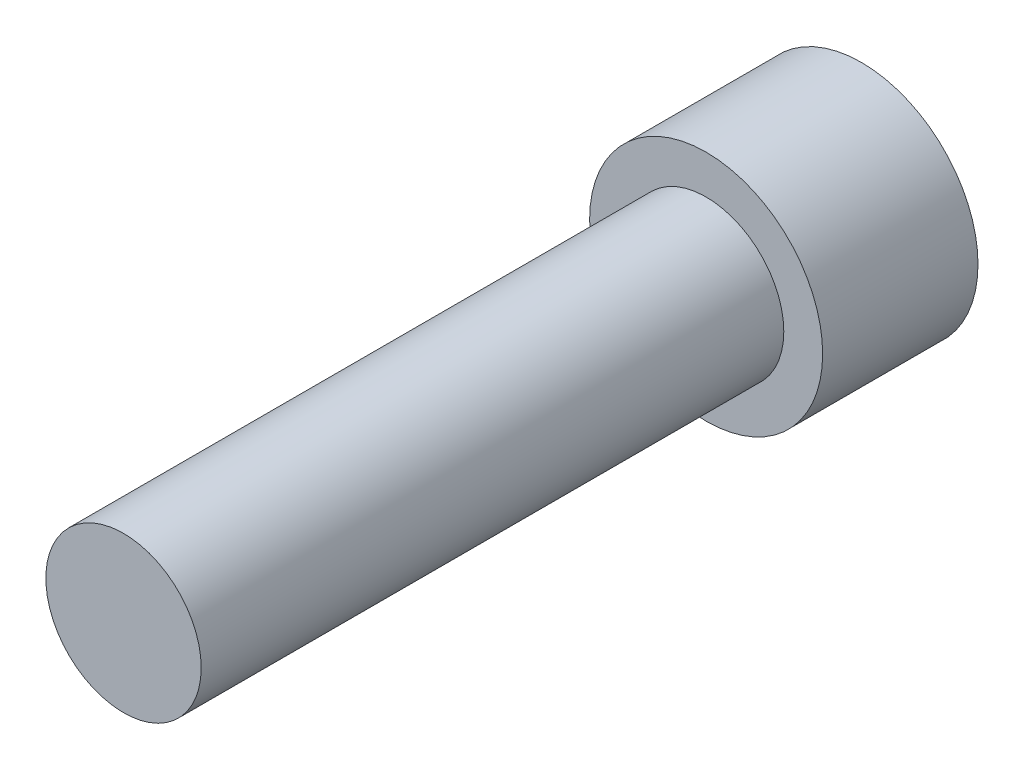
ISO-10303-21;
HEADER;
FILE_DESCRIPTION(('STEP AP214'),'2;1');
FILE_NAME('part.step','',(''),(''),'','','');
FILE_SCHEMA(('AUTOMOTIVE_DESIGN { 1 0 10303 214 1 1 1 1 }'));
ENDSEC;
DATA;
#1=APPLICATION_CONTEXT('core data for automotive mechanical design processes');
#2=APPLICATION_PROTOCOL_DEFINITION('international standard','automotive_design',2000,#1);
#3=PRODUCT_CONTEXT('',#1,'mechanical');
#4=PRODUCT('Part','Part','',(#3));
#5=PRODUCT_RELATED_PRODUCT_CATEGORY('part','',(#4));
#6=PRODUCT_DEFINITION_FORMATION('','',#4);
#7=PRODUCT_DEFINITION_CONTEXT('part definition',#1,'design');
#8=PRODUCT_DEFINITION('design','',#6,#7);
#9=PRODUCT_DEFINITION_SHAPE('','',#8);
#10=(LENGTH_UNIT() NAMED_UNIT(*) SI_UNIT(.MILLI.,.METRE.));
#11=(NAMED_UNIT(*) PLANE_ANGLE_UNIT() SI_UNIT($,.RADIAN.));
#12=(NAMED_UNIT(*) SI_UNIT($,.STERADIAN.) SOLID_ANGLE_UNIT());
#13=UNCERTAINTY_MEASURE_WITH_UNIT(LENGTH_MEASURE(1.E-05),#10,'distance_accuracy_value','');
#14=(GEOMETRIC_REPRESENTATION_CONTEXT(3) GLOBAL_UNCERTAINTY_ASSIGNED_CONTEXT((#13)) GLOBAL_UNIT_ASSIGNED_CONTEXT((#10,
#11,#12)) REPRESENTATION_CONTEXT('',''));
#15=CARTESIAN_POINT('',(0.,0.,0.));
#16=DIRECTION('',(0.,0.,1.));
#17=DIRECTION('',(1.,0.,0.));
#18=AXIS2_PLACEMENT_3D('',#15,#16,#17);
#19=CARTESIAN_POINT('',(0.,0.,45.));
#20=DIRECTION('',(0.,0.,1.));
#21=DIRECTION('',(1.,0.,0.));
#22=AXIS2_PLACEMENT_3D('',#19,#20,#21);
#23=PLANE('',#22);
#24=CARTESIAN_POINT('',(0.,0.,45.));
#25=DIRECTION('',(0.,0.,1.));
#26=DIRECTION('',(1.,0.,0.));
#27=AXIS2_PLACEMENT_3D('',#24,#25,#26);
#28=CIRCLE('',#27,6.);
#29=CARTESIAN_POINT('',(6.,0.,45.));
#30=VERTEX_POINT('',#29);
#31=EDGE_CURVE('E11',#30,#30,#28,.T.);
#32=ORIENTED_EDGE('',*,*,#31,.T.);
#33=EDGE_LOOP('',(#32));
#34=FACE_BOUND('',#33,.T.);
#35=ADVANCED_FACE('F32',(#34),#23,.T.);
#36=CARTESIAN_POINT('',(0.,0.,45.));
#37=DIRECTION('',(0.,0.,1.));
#38=DIRECTION('',(1.,0.,0.));
#39=AXIS2_PLACEMENT_3D('',#36,#37,#38);
#40=CYLINDRICAL_SURFACE('',#39,6.);
#41=CARTESIAN_POINT('',(0.,0.,0.));
#42=DIRECTION('',(0.,0.,1.));
#43=DIRECTION('',(1.,0.,0.));
#44=AXIS2_PLACEMENT_3D('',#41,#42,#43);
#45=CIRCLE('',#44,6.);
#46=CARTESIAN_POINT('',(6.,0.,0.));
#47=VERTEX_POINT('',#46);
#48=EDGE_CURVE('E39',#47,#47,#45,.T.);
#49=ORIENTED_EDGE('',*,*,#48,.T.);
#50=EDGE_LOOP('',(#49));
#51=FACE_BOUND('',#50,.T.);
#52=ORIENTED_EDGE('',*,*,#31,.F.);
#53=EDGE_LOOP('',(#52));
#54=FACE_BOUND('',#53,.T.);
#55=ADVANCED_FACE('F146',(#51,#54),#40,.T.);
#56=CARTESIAN_POINT('',(0.,-6.,0.));
#57=DIRECTION('',(0.,0.,1.));
#58=DIRECTION('',(1.,0.,0.));
#59=AXIS2_PLACEMENT_3D('',#56,#57,#58);
#60=PLANE('',#59);
#61=CARTESIAN_POINT('',(0.,0.,0.));
#62=DIRECTION('',(0.,0.,1.));
#63=DIRECTION('',(1.,0.,0.));
#64=AXIS2_PLACEMENT_3D('',#61,#62,#63);
#65=CIRCLE('',#64,9.);
#66=CARTESIAN_POINT('',(9.,0.,0.));
#67=VERTEX_POINT('',#66);
#68=EDGE_CURVE('E141',#67,#67,#65,.T.);
#69=ORIENTED_EDGE('',*,*,#68,.T.);
#70=EDGE_LOOP('',(#69));
#71=FACE_BOUND('',#70,.T.);
#72=ORIENTED_EDGE('',*,*,#48,.F.);
#73=EDGE_LOOP('',(#72));
#74=FACE_BOUND('',#73,.T.);
#75=ADVANCED_FACE('F149',(#71,#74),#60,.T.);
#76=CARTESIAN_POINT('',(0.,0.,45.));
#77=DIRECTION('',(0.,0.,1.));
#78=DIRECTION('',(1.,0.,0.));
#79=AXIS2_PLACEMENT_3D('',#76,#77,#78);
#80=CYLINDRICAL_SURFACE('',#79,9.);
#81=CARTESIAN_POINT('',(0.,0.,-12.));
#82=DIRECTION('',(0.,0.,1.));
#83=DIRECTION('',(1.,0.,0.));
#84=AXIS2_PLACEMENT_3D('',#81,#82,#83);
#85=CIRCLE('',#84,9.);
#86=CARTESIAN_POINT('',(9.,0.,-12.));
#87=VERTEX_POINT('',#86);
#88=EDGE_CURVE('E133',#87,#87,#85,.T.);
#89=ORIENTED_EDGE('',*,*,#88,.T.);
#90=EDGE_LOOP('',(#89));
#91=FACE_BOUND('',#90,.T.);
#92=ORIENTED_EDGE('',*,*,#68,.F.);
#93=EDGE_LOOP('',(#92));
#94=FACE_BOUND('',#93,.T.);
#95=ADVANCED_FACE('F151',(#91,#94),#80,.T.);
#96=CARTESIAN_POINT('',(0.,-9.,-12.));
#97=DIRECTION('',(0.,0.,-1.));
#98=DIRECTION('',(-1.,0.,0.));
#99=AXIS2_PLACEMENT_3D('',#96,#97,#98);
#100=PLANE('',#99);
#101=DIRECTION('',(0.866025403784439,-0.5,0.));
#102=VECTOR('',#101,1.);
#103=CARTESIAN_POINT('',(0.,5.77350269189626,-12.));
#104=LINE('',#103,#102);
#105=CARTESIAN_POINT('',(0.,5.77350269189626,-12.));
#106=VERTEX_POINT('',#105);
#107=CARTESIAN_POINT('',(5.,2.88675134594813,-12.));
#108=VERTEX_POINT('',#107);
#109=EDGE_CURVE('E46',#106,#108,#104,.T.);
#110=ORIENTED_EDGE('',*,*,#109,.F.);
#111=DIRECTION('',(0.866025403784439,0.5,0.));
#112=VECTOR('',#111,1.);
#113=CARTESIAN_POINT('',(-5.,2.88675134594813,-12.));
#114=LINE('',#113,#112);
#115=CARTESIAN_POINT('',(-5.,2.88675134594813,-12.));
#116=VERTEX_POINT('',#115);
#117=EDGE_CURVE('E129',#116,#106,#114,.T.);
#118=ORIENTED_EDGE('',*,*,#117,.F.);
#119=DIRECTION('',(0.,1.,0.));
#120=VECTOR('',#119,1.);
#121=CARTESIAN_POINT('',(-5.,-2.88675134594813,-12.));
#122=LINE('',#121,#120);
#123=CARTESIAN_POINT('',(-5.,-2.88675134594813,-12.));
#124=VERTEX_POINT('',#123);
#125=EDGE_CURVE('E127',#124,#116,#122,.T.);
#126=ORIENTED_EDGE('',*,*,#125,.F.);
#127=DIRECTION('',(-0.866025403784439,0.5,0.));
#128=VECTOR('',#127,1.);
#129=CARTESIAN_POINT('',(0.,-5.77350269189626,-12.));
#130=LINE('',#129,#128);
#131=CARTESIAN_POINT('',(0.,-5.77350269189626,-12.));
#132=VERTEX_POINT('',#131);
#133=EDGE_CURVE('E94',#132,#124,#130,.T.);
#134=ORIENTED_EDGE('',*,*,#133,.F.);
#135=DIRECTION('',(-0.866025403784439,-0.5,0.));
#136=VECTOR('',#135,1.);
#137=CARTESIAN_POINT('',(5.,-2.88675134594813,-12.));
#138=LINE('',#137,#136);
#139=CARTESIAN_POINT('',(5.,-2.88675134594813,-12.));
#140=VERTEX_POINT('',#139);
#141=EDGE_CURVE('E123',#140,#132,#138,.T.);
#142=ORIENTED_EDGE('',*,*,#141,.F.);
#143=DIRECTION('',(0.,-1.,0.));
#144=VECTOR('',#143,1.);
#145=CARTESIAN_POINT('',(5.,2.88675134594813,-12.));
#146=LINE('',#145,#144);
#147=EDGE_CURVE('E120',#108,#140,#146,.T.);
#148=ORIENTED_EDGE('',*,*,#147,.F.);
#149=EDGE_LOOP('',(#110,#118,#126,#134,#142,#148));
#150=FACE_BOUND('',#149,.T.);
#151=ORIENTED_EDGE('',*,*,#88,.F.);
#152=EDGE_LOOP('',(#151));
#153=FACE_BOUND('',#152,.T.);
#154=ADVANCED_FACE('F158',(#150,#153),#100,.T.);
#155=CARTESIAN_POINT('',(0.,5.77350269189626,-2.));
#156=DIRECTION('',(0.5,0.866025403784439,0.));
#157=DIRECTION('',(-0.866025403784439,0.5,0.));
#158=AXIS2_PLACEMENT_3D('',#155,#156,#157);
#159=PLANE('',#158);
#160=ORIENTED_EDGE('',*,*,#109,.T.);
#161=DIRECTION('',(0.,0.,-1.));
#162=VECTOR('',#161,1.);
#163=CARTESIAN_POINT('',(5.,2.88675134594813,-2.));
#164=LINE('',#163,#162);
#165=CARTESIAN_POINT('',(5.,2.88675134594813,-2.));
#166=VERTEX_POINT('',#165);
#167=EDGE_CURVE('E76',#166,#108,#164,.T.);
#168=ORIENTED_EDGE('',*,*,#167,.F.);
#169=DIRECTION('',(0.866025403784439,-0.5,0.));
#170=VECTOR('',#169,1.);
#171=CARTESIAN_POINT('',(0.,5.77350269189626,-2.));
#172=LINE('',#171,#170);
#173=CARTESIAN_POINT('',(0.,5.77350269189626,-2.));
#174=VERTEX_POINT('',#173);
#175=EDGE_CURVE('E131',#174,#166,#172,.T.);
#176=ORIENTED_EDGE('',*,*,#175,.F.);
#177=DIRECTION('',(0.,0.,-1.));
#178=VECTOR('',#177,1.);
#179=CARTESIAN_POINT('',(0.,5.77350269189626,-2.));
#180=LINE('',#179,#178);
#181=EDGE_CURVE('E54',#174,#106,#180,.T.);
#182=ORIENTED_EDGE('',*,*,#181,.T.);
#183=EDGE_LOOP('',(#160,#168,#176,#182));
#184=FACE_BOUND('',#183,.T.);
#185=ADVANCED_FACE('F189',(#184),#159,.F.);
#186=CARTESIAN_POINT('',(-5.,2.88675134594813,-2.));
#187=DIRECTION('',(-0.5,0.866025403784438,0.));
#188=DIRECTION('',(-0.866025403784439,-0.5,0.));
#189=AXIS2_PLACEMENT_3D('',#186,#187,#188);
#190=PLANE('',#189);
#191=ORIENTED_EDGE('',*,*,#117,.T.);
#192=ORIENTED_EDGE('',*,*,#181,.F.);
#193=DIRECTION('',(0.866025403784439,0.5,0.));
#194=VECTOR('',#193,1.);
#195=CARTESIAN_POINT('',(-5.,2.88675134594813,-2.));
#196=LINE('',#195,#194);
#197=CARTESIAN_POINT('',(-5.,2.88675134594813,-2.));
#198=VERTEX_POINT('',#197);
#199=EDGE_CURVE('E106',#198,#174,#196,.T.);
#200=ORIENTED_EDGE('',*,*,#199,.F.);
#201=DIRECTION('',(0.,0.,-1.));
#202=VECTOR('',#201,1.);
#203=CARTESIAN_POINT('',(-5.,2.88675134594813,-2.));
#204=LINE('',#203,#202);
#205=EDGE_CURVE('E98',#198,#116,#204,.T.);
#206=ORIENTED_EDGE('',*,*,#205,.T.);
#207=EDGE_LOOP('',(#191,#192,#200,#206));
#208=FACE_BOUND('',#207,.T.);
#209=ADVANCED_FACE('F199',(#208),#190,.F.);
#210=CARTESIAN_POINT('',(-5.,-2.88675134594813,-2.));
#211=DIRECTION('',(-1.,0.,0.));
#212=DIRECTION('',(0.,0.,1.));
#213=AXIS2_PLACEMENT_3D('',#210,#211,#212);
#214=PLANE('',#213);
#215=ORIENTED_EDGE('',*,*,#125,.T.);
#216=ORIENTED_EDGE('',*,*,#205,.F.);
#217=DIRECTION('',(0.,1.,0.));
#218=VECTOR('',#217,1.);
#219=CARTESIAN_POINT('',(-5.,-2.88675134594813,-2.));
#220=LINE('',#219,#218);
#221=CARTESIAN_POINT('',(-5.,-2.88675134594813,-2.));
#222=VERTEX_POINT('',#221);
#223=EDGE_CURVE('E102',#222,#198,#220,.T.);
#224=ORIENTED_EDGE('',*,*,#223,.F.);
#225=DIRECTION('',(0.,0.,-1.));
#226=VECTOR('',#225,1.);
#227=CARTESIAN_POINT('',(-5.,-2.88675134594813,-2.));
#228=LINE('',#227,#226);
#229=EDGE_CURVE('E87',#222,#124,#228,.T.);
#230=ORIENTED_EDGE('',*,*,#229,.T.);
#231=EDGE_LOOP('',(#215,#216,#224,#230));
#232=FACE_BOUND('',#231,.T.);
#233=ADVANCED_FACE('F103',(#232),#214,.F.);
#234=CARTESIAN_POINT('',(0.,-5.77350269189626,-2.));
#235=DIRECTION('',(-0.5,-0.866025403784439,0.));
#236=DIRECTION('',(0.866025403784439,-0.5,0.));
#237=AXIS2_PLACEMENT_3D('',#234,#235,#236);
#238=PLANE('',#237);
#239=ORIENTED_EDGE('',*,*,#133,.T.);
#240=ORIENTED_EDGE('',*,*,#229,.F.);
#241=DIRECTION('',(-0.866025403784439,0.5,0.));
#242=VECTOR('',#241,1.);
#243=CARTESIAN_POINT('',(0.,-5.77350269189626,-2.));
#244=LINE('',#243,#242);
#245=CARTESIAN_POINT('',(0.,-5.77350269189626,-2.));
#246=VERTEX_POINT('',#245);
#247=EDGE_CURVE('E91',#246,#222,#244,.T.);
#248=ORIENTED_EDGE('',*,*,#247,.F.);
#249=DIRECTION('',(0.,0.,-1.));
#250=VECTOR('',#249,1.);
#251=CARTESIAN_POINT('',(0.,-5.77350269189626,-2.));
#252=LINE('',#251,#250);
#253=EDGE_CURVE('E99',#246,#132,#252,.T.);
#254=ORIENTED_EDGE('',*,*,#253,.T.);
#255=EDGE_LOOP('',(#239,#240,#248,#254));
#256=FACE_BOUND('',#255,.T.);
#257=ADVANCED_FACE('F89',(#256),#238,.F.);
#258=CARTESIAN_POINT('',(5.,-2.88675134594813,-2.));
#259=DIRECTION('',(0.5,-0.866025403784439,0.));
#260=DIRECTION('',(0.866025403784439,0.5,0.));
#261=AXIS2_PLACEMENT_3D('',#258,#259,#260);
#262=PLANE('',#261);
#263=ORIENTED_EDGE('',*,*,#141,.T.);
#264=ORIENTED_EDGE('',*,*,#253,.F.);
#265=DIRECTION('',(-0.866025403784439,-0.5,0.));
#266=VECTOR('',#265,1.);
#267=CARTESIAN_POINT('',(5.,-2.88675134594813,-2.));
#268=LINE('',#267,#266);
#269=CARTESIAN_POINT('',(5.,-2.88675134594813,-2.));
#270=VERTEX_POINT('',#269);
#271=EDGE_CURVE('E112',#270,#246,#268,.T.);
#272=ORIENTED_EDGE('',*,*,#271,.F.);
#273=DIRECTION('',(0.,0.,-1.));
#274=VECTOR('',#273,1.);
#275=CARTESIAN_POINT('',(5.,-2.88675134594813,-2.));
#276=LINE('',#275,#274);
#277=EDGE_CURVE('E136',#270,#140,#276,.T.);
#278=ORIENTED_EDGE('',*,*,#277,.T.);
#279=EDGE_LOOP('',(#263,#264,#272,#278));
#280=FACE_BOUND('',#279,.T.);
#281=ADVANCED_FACE('F224',(#280),#262,.F.);
#282=CARTESIAN_POINT('',(5.,2.88675134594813,-2.));
#283=DIRECTION('',(1.,0.,0.));
#284=DIRECTION('',(0.,1.,0.));
#285=AXIS2_PLACEMENT_3D('',#282,#283,#284);
#286=PLANE('',#285);
#287=ORIENTED_EDGE('',*,*,#147,.T.);
#288=ORIENTED_EDGE('',*,*,#277,.F.);
#289=DIRECTION('',(0.,-1.,0.));
#290=VECTOR('',#289,1.);
#291=CARTESIAN_POINT('',(5.,2.88675134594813,-2.));
#292=LINE('',#291,#290);
#293=EDGE_CURVE('E114',#166,#270,#292,.T.);
#294=ORIENTED_EDGE('',*,*,#293,.F.);
#295=ORIENTED_EDGE('',*,*,#167,.T.);
#296=EDGE_LOOP('',(#287,#288,#294,#295));
#297=FACE_BOUND('',#296,.T.);
#298=ADVANCED_FACE('F233',(#297),#286,.F.);
#299=CARTESIAN_POINT('',(0.,5.77350269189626,-2.));
#300=DIRECTION('',(0.,0.,1.));
#301=DIRECTION('',(1.,0.,0.));
#302=AXIS2_PLACEMENT_3D('',#299,#300,#301);
#303=PLANE('',#302);
#304=ORIENTED_EDGE('',*,*,#175,.T.);
#305=ORIENTED_EDGE('',*,*,#293,.T.);
#306=ORIENTED_EDGE('',*,*,#271,.T.);
#307=ORIENTED_EDGE('',*,*,#247,.T.);
#308=ORIENTED_EDGE('',*,*,#223,.T.);
#309=ORIENTED_EDGE('',*,*,#199,.T.);
#310=EDGE_LOOP('',(#304,#305,#306,#307,#308,#309));
#311=FACE_BOUND('',#310,.T.);
#312=ADVANCED_FACE('F109',(#311),#303,.F.);
#313=CLOSED_SHELL('',(#35,#55,#75,#95,#154,#185,#209,#233,#257,#281,#298,#312));
#314=MANIFOLD_SOLID_BREP('B2',#313);
#315=ADVANCED_BREP_SHAPE_REPRESENTATION('',(#18,#314),#14);
#316=SHAPE_DEFINITION_REPRESENTATION(#9,#315);
ENDSEC;
END-ISO-10303-21;
